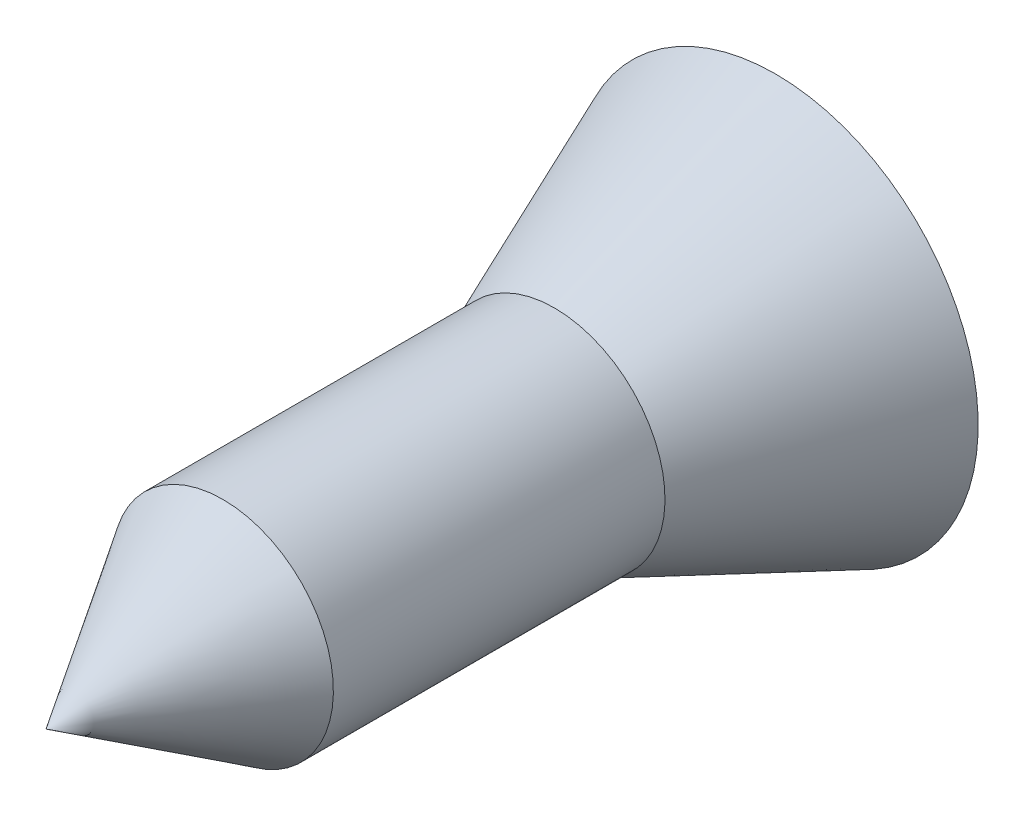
from build123d import *


with BuildPart() as part:
    # Sketch1 → Revolve1 (revolve)
    with BuildSketch(Plane.XZ, mode=Mode.PRIVATE) as revolve1_sk:
        Polygon((2.9, 4.1), (1.4, 6.5), (1.4, -3.4), (4.15, -3.4), (2.9, -0.4), align=None)
    revolve(revolve1_sk.sketch.rotate(Axis((1.4, 0, 6.5), (0, 0, -1)), 270), axis=Axis((1.4, 0, 6.5), (0, 0, -1)))


solid = part.part
